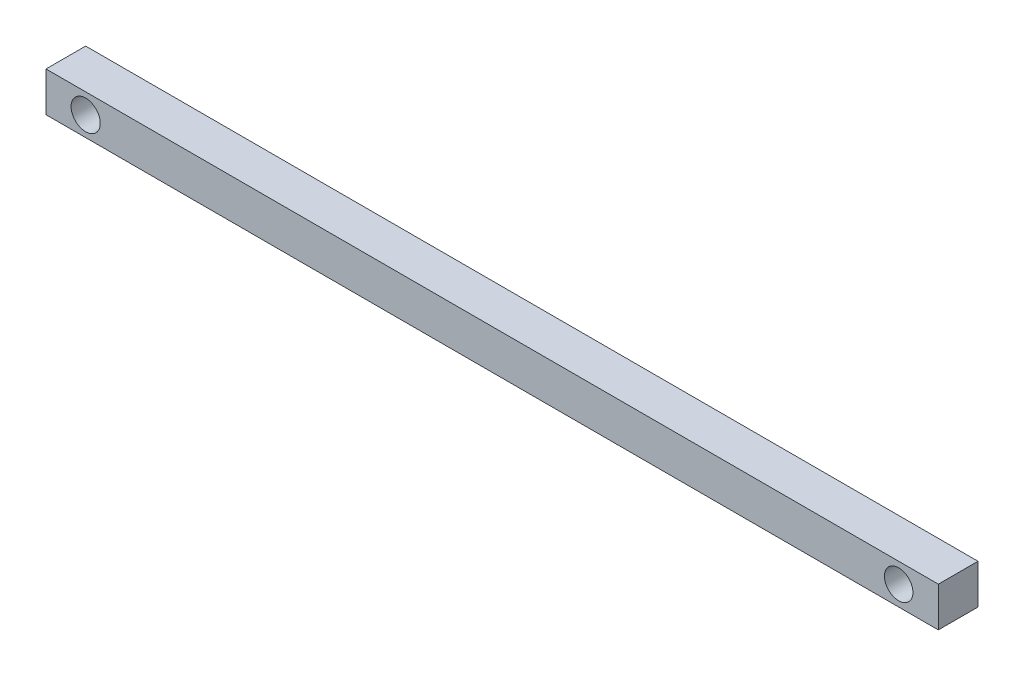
from build123d import *

# Parameters (mm, degrees)
ESQUISSE1_W      = 450
ESQUISSE1_H      = 20
ESQUISSE1_R      = 7.352631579
ESQUISSE1_R_2    = 7.197123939
EXTRUSION1_DEPTH = 20


with BuildPart() as part:
    # Esquisse1 → Extrusion1 (new body)
    with BuildSketch(Plane.XY):
        with Locations((190.558725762, 8.768559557)):
            Rectangle(ESQUISSE1_W, ESQUISSE1_H)
        with Locations((-14.441274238, 8.707063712)):
            Circle(ESQUISSE1_R, mode=Mode.SUBTRACT)
        with Locations((395.558725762, 8.707063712)):
            Circle(ESQUISSE1_R_2, mode=Mode.SUBTRACT)
    extrude(amount=EXTRUSION1_DEPTH)


solid = part.part
